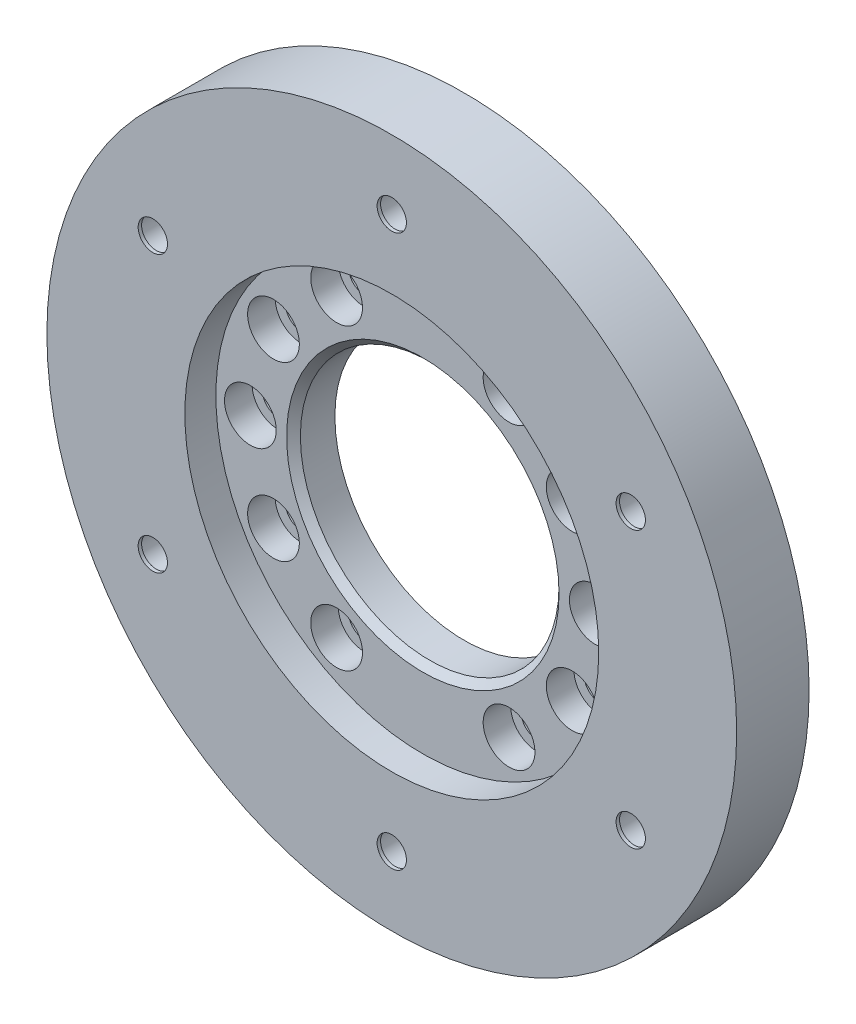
ISO-10303-21;
HEADER;
FILE_DESCRIPTION(('STEP AP214'),'2;1');
FILE_NAME('part.step','',(''),(''),'','','');
FILE_SCHEMA(('AUTOMOTIVE_DESIGN { 1 0 10303 214 1 1 1 1 }'));
ENDSEC;
DATA;
#1=APPLICATION_CONTEXT('core data for automotive mechanical design processes');
#2=APPLICATION_PROTOCOL_DEFINITION('international standard','automotive_design',2000,#1);
#3=PRODUCT_CONTEXT('',#1,'mechanical');
#4=PRODUCT('Part','Part','',(#3));
#5=PRODUCT_RELATED_PRODUCT_CATEGORY('part','',(#4));
#6=PRODUCT_DEFINITION_FORMATION('','',#4);
#7=PRODUCT_DEFINITION_CONTEXT('part definition',#1,'design');
#8=PRODUCT_DEFINITION('design','',#6,#7);
#9=PRODUCT_DEFINITION_SHAPE('','',#8);
#10=(LENGTH_UNIT() NAMED_UNIT(*) SI_UNIT(.MILLI.,.METRE.));
#11=(NAMED_UNIT(*) PLANE_ANGLE_UNIT() SI_UNIT($,.RADIAN.));
#12=(NAMED_UNIT(*) SI_UNIT($,.STERADIAN.) SOLID_ANGLE_UNIT());
#13=UNCERTAINTY_MEASURE_WITH_UNIT(LENGTH_MEASURE(1.E-05),#10,'distance_accuracy_value','');
#14=(GEOMETRIC_REPRESENTATION_CONTEXT(3) GLOBAL_UNCERTAINTY_ASSIGNED_CONTEXT((#13)) GLOBAL_UNIT_ASSIGNED_CONTEXT((#10,
#11,#12)) REPRESENTATION_CONTEXT('',''));
#15=CARTESIAN_POINT('',(0.,0.,0.));
#16=DIRECTION('',(0.,0.,1.));
#17=DIRECTION('',(1.,0.,0.));
#18=AXIS2_PLACEMENT_3D('',#15,#16,#17);
#19=CARTESIAN_POINT('',(0.,0.,21.));
#20=DIRECTION('',(0.,0.,-1.));
#21=DIRECTION('',(-1.,0.,0.));
#22=AXIS2_PLACEMENT_3D('',#19,#20,#21);
#23=CYLINDRICAL_SURFACE('',#22,100.);
#24=CARTESIAN_POINT('',(0.,0.,21.));
#25=DIRECTION('',(0.,0.,1.));
#26=DIRECTION('',(1.,0.,0.));
#27=AXIS2_PLACEMENT_3D('',#24,#25,#26);
#28=CIRCLE('',#27,100.);
#29=CARTESIAN_POINT('',(-100.,0.,21.));
#30=VERTEX_POINT('',#29);
#31=EDGE_CURVE('E41',#30,#30,#28,.T.);
#32=CARTESIAN_POINT('',(0.,0.,0.));
#33=DIRECTION('',(0.,0.,1.));
#34=DIRECTION('',(1.,0.,0.));
#35=AXIS2_PLACEMENT_3D('',#32,#33,#34);
#36=CIRCLE('',#35,100.);
#37=CARTESIAN_POINT('',(-100.,0.,0.));
#38=VERTEX_POINT('',#37);
#39=EDGE_CURVE('E45',#38,#38,#36,.T.);
#40=CARTESIAN_POINT('',(-100.,0.,21.));
#41=CARTESIAN_POINT('',(-100.,0.,20.78125));
#42=CARTESIAN_POINT('',(-100.,0.,20.5625));
#43=CARTESIAN_POINT('',(-100.,0.,20.125));
#44=CARTESIAN_POINT('',(-100.,0.,19.90625));
#45=CARTESIAN_POINT('',(-100.,0.,19.46875));
#46=CARTESIAN_POINT('',(-100.,0.,19.25));
#47=CARTESIAN_POINT('',(-100.,0.,18.8125));
#48=CARTESIAN_POINT('',(-100.,0.,18.59375));
#49=CARTESIAN_POINT('',(-100.,0.,18.15625));
#50=CARTESIAN_POINT('',(-100.,0.,17.9375));
#51=CARTESIAN_POINT('',(-100.,0.,17.5));
#52=CARTESIAN_POINT('',(-100.,0.,17.28125));
#53=CARTESIAN_POINT('',(-100.,0.,16.84375));
#54=CARTESIAN_POINT('',(-100.,0.,16.625));
#55=CARTESIAN_POINT('',(-100.,0.,16.1875));
#56=CARTESIAN_POINT('',(-100.,0.,15.96875));
#57=CARTESIAN_POINT('',(-100.,0.,15.53125));
#58=CARTESIAN_POINT('',(-100.,0.,15.3125));
#59=CARTESIAN_POINT('',(-100.,0.,14.875));
#60=CARTESIAN_POINT('',(-100.,0.,14.65625));
#61=CARTESIAN_POINT('',(-100.,0.,14.21875));
#62=CARTESIAN_POINT('',(-100.,0.,14.));
#63=CARTESIAN_POINT('',(-100.,0.,13.5625));
#64=CARTESIAN_POINT('',(-100.,0.,13.34375));
#65=CARTESIAN_POINT('',(-100.,0.,12.90625));
#66=CARTESIAN_POINT('',(-100.,0.,12.6875));
#67=CARTESIAN_POINT('',(-100.,0.,12.25));
#68=CARTESIAN_POINT('',(-100.,0.,12.03125));
#69=CARTESIAN_POINT('',(-100.,0.,11.59375));
#70=CARTESIAN_POINT('',(-100.,0.,11.375));
#71=CARTESIAN_POINT('',(-100.,0.,10.9375));
#72=CARTESIAN_POINT('',(-100.,0.,10.71875));
#73=CARTESIAN_POINT('',(-100.,0.,10.28125));
#74=CARTESIAN_POINT('',(-100.,0.,10.0625));
#75=CARTESIAN_POINT('',(-100.,0.,9.625));
#76=CARTESIAN_POINT('',(-100.,0.,9.40625));
#77=CARTESIAN_POINT('',(-100.,0.,8.96875));
#78=CARTESIAN_POINT('',(-100.,0.,8.75));
#79=CARTESIAN_POINT('',(-100.,0.,8.3125));
#80=CARTESIAN_POINT('',(-100.,0.,8.09375));
#81=CARTESIAN_POINT('',(-100.,0.,7.65625));
#82=CARTESIAN_POINT('',(-100.,0.,7.4375));
#83=CARTESIAN_POINT('',(-100.,0.,7.));
#84=CARTESIAN_POINT('',(-100.,0.,6.78125));
#85=CARTESIAN_POINT('',(-100.,0.,6.34375));
#86=CARTESIAN_POINT('',(-100.,0.,6.125));
#87=CARTESIAN_POINT('',(-100.,0.,5.6875));
#88=CARTESIAN_POINT('',(-100.,0.,5.46875));
#89=CARTESIAN_POINT('',(-100.,0.,5.03125));
#90=CARTESIAN_POINT('',(-100.,0.,4.8125));
#91=CARTESIAN_POINT('',(-100.,0.,4.375));
#92=CARTESIAN_POINT('',(-100.,0.,4.15625));
#93=CARTESIAN_POINT('',(-100.,0.,3.71875));
#94=CARTESIAN_POINT('',(-100.,0.,3.5));
#95=CARTESIAN_POINT('',(-100.,0.,3.0625));
#96=CARTESIAN_POINT('',(-100.,0.,2.84375));
#97=CARTESIAN_POINT('',(-100.,0.,2.40625));
#98=CARTESIAN_POINT('',(-100.,0.,2.1875));
#99=CARTESIAN_POINT('',(-100.,0.,1.75));
#100=CARTESIAN_POINT('',(-100.,0.,1.53125));
#101=CARTESIAN_POINT('',(-100.,0.,1.09375));
#102=CARTESIAN_POINT('',(-100.,0.,0.875000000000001));
#103=CARTESIAN_POINT('',(-100.,0.,0.4375));
#104=CARTESIAN_POINT('',(-100.,0.,0.21875));
#105=CARTESIAN_POINT('',(-100.,0.,0.));
#106=B_SPLINE_CURVE_WITH_KNOTS('',3,(#40,#41,#42,#43,#44,#45,#46,#47,#48,#49,#50,#51,#52,#53,
#54,#55,#56,#57,#58,#59,#60,#61,#62,#63,#64,#65,#66,#67,#68,#69,#70,#71,#72,#73,#74,#75,#76,#77,
#78,#79,#80,#81,#82,#83,#84,#85,#86,#87,#88,#89,#90,#91,#92,#93,#94,#95,#96,#97,#98,#99,#100,
#101,#102,#103,#104,#105),.UNSPECIFIED.,.F.,.F.,(4,2,2,2,2,2,2,2,2,2,2,2,2,2,2,2,2,2,2,2,2,2,2,
2,2,2,2,2,2,2,2,2,4),(0.,0.656249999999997,1.3125,1.96875,2.625,3.28125,3.9375,4.59375,5.25,
5.90625,6.5625,7.21875,7.875,8.53125,9.1875,9.84375,10.5,11.15625,11.8125,12.46875,13.125,
13.78125,14.4375,15.09375,15.75,16.40625,17.0625,17.71875,18.375,19.03125,19.6875,20.34375,21.),.UNSPECIFIED.);
#107=EDGE_CURVE('BSEAM30',#30,#38,#106,.T.);
#108=ORIENTED_EDGE('',*,*,#31,.F.);
#109=ORIENTED_EDGE('',*,*,#39,.T.);
#110=ORIENTED_EDGE('',*,*,#107,.T.);
#111=ORIENTED_EDGE('',*,*,#107,.F.);
#112=EDGE_LOOP('',(#108,#110,#109,#111));
#113=FACE_BOUND('',#112,.T.);
#114=ADVANCED_FACE('F30',(#113),#23,.T.);
#115=CARTESIAN_POINT('',(0.,0.,21.));
#116=DIRECTION('',(0.,0.,1.));
#117=DIRECTION('',(1.,0.,0.));
#118=AXIS2_PLACEMENT_3D('',#115,#116,#117);
#119=PLANE('',#118);
#120=CARTESIAN_POINT('',(0.,0.,21.));
#121=DIRECTION('',(0.,0.,1.));
#122=DIRECTION('',(1.,0.,0.));
#123=AXIS2_PLACEMENT_3D('',#120,#121,#122);
#124=CIRCLE('',#123,60.);
#125=CARTESIAN_POINT('',(60.,0.,21.));
#126=VERTEX_POINT('',#125);
#127=EDGE_CURVE('E123',#126,#126,#124,.T.);
#128=ORIENTED_EDGE('',*,*,#127,.F.);
#129=EDGE_LOOP('',(#128));
#130=FACE_BOUND('',#129,.T.);
#131=CARTESIAN_POINT('',(-69.2820323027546,40.0000000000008,21.));
#132=DIRECTION('',(0.,0.,1.));
#133=DIRECTION('',(1.,0.,0.));
#134=AXIS2_PLACEMENT_3D('',#131,#132,#133);
#135=CIRCLE('',#134,4.24999999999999);
#136=CARTESIAN_POINT('',(-65.0320323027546,40.0000000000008,21.));
#137=VERTEX_POINT('',#136);
#138=EDGE_CURVE('E48',#137,#137,#135,.T.);
#139=ORIENTED_EDGE('',*,*,#138,.F.);
#140=EDGE_LOOP('',(#139));
#141=FACE_BOUND('',#140,.T.);
#142=CARTESIAN_POINT('',(-69.2820323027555,-39.9999999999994,21.));
#143=DIRECTION('',(0.,0.,1.));
#144=DIRECTION('',(1.,0.,0.));
#145=AXIS2_PLACEMENT_3D('',#142,#143,#144);
#146=CIRCLE('',#145,4.24999999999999);
#147=CARTESIAN_POINT('',(-65.0320323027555,-39.9999999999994,21.));
#148=VERTEX_POINT('',#147);
#149=EDGE_CURVE('E53',#148,#148,#146,.T.);
#150=ORIENTED_EDGE('',*,*,#149,.F.);
#151=EDGE_LOOP('',(#150));
#152=FACE_BOUND('',#151,.T.);
#153=CARTESIAN_POINT('',(-5.58637337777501E-13,-80.,21.));
#154=DIRECTION('',(0.,0.,1.));
#155=DIRECTION('',(1.,0.,0.));
#156=AXIS2_PLACEMENT_3D('',#153,#154,#155);
#157=CIRCLE('',#156,4.24999999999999);
#158=CARTESIAN_POINT('',(4.24999999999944,-80.,21.));
#159=VERTEX_POINT('',#158);
#160=EDGE_CURVE('E58',#159,#159,#157,.T.);
#161=ORIENTED_EDGE('',*,*,#160,.F.);
#162=EDGE_LOOP('',(#161));
#163=FACE_BOUND('',#162,.T.);
#164=CARTESIAN_POINT('',(69.2820323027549,-40.0000000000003,21.));
#165=DIRECTION('',(0.,0.,1.));
#166=DIRECTION('',(1.,0.,0.));
#167=AXIS2_PLACEMENT_3D('',#164,#165,#166);
#168=CIRCLE('',#167,4.24999999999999);
#169=CARTESIAN_POINT('',(73.5320323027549,-40.0000000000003,21.));
#170=VERTEX_POINT('',#169);
#171=EDGE_CURVE('E63',#170,#170,#168,.T.);
#172=ORIENTED_EDGE('',*,*,#171,.F.);
#173=EDGE_LOOP('',(#172));
#174=FACE_BOUND('',#173,.T.);
#175=CARTESIAN_POINT('',(69.2820323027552,39.9999999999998,21.));
#176=DIRECTION('',(0.,0.,1.));
#177=DIRECTION('',(1.,0.,0.));
#178=AXIS2_PLACEMENT_3D('',#175,#176,#177);
#179=CIRCLE('',#178,4.24999999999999);
#180=CARTESIAN_POINT('',(73.5320323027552,39.9999999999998,21.));
#181=VERTEX_POINT('',#180);
#182=EDGE_CURVE('E68',#181,#181,#179,.T.);
#183=ORIENTED_EDGE('',*,*,#182,.F.);
#184=EDGE_LOOP('',(#183));
#185=FACE_BOUND('',#184,.T.);
#186=CARTESIAN_POINT('',(0.,80.,21.));
#187=DIRECTION('',(0.,0.,1.));
#188=DIRECTION('',(1.,0.,0.));
#189=AXIS2_PLACEMENT_3D('',#186,#187,#188);
#190=CIRCLE('',#189,4.24999999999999);
#191=CARTESIAN_POINT('',(4.24999999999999,80.,21.));
#192=VERTEX_POINT('',#191);
#193=EDGE_CURVE('E73',#192,#192,#190,.T.);
#194=ORIENTED_EDGE('',*,*,#193,.F.);
#195=EDGE_LOOP('',(#194));
#196=FACE_BOUND('',#195,.T.);
#197=ORIENTED_EDGE('',*,*,#31,.T.);
#198=EDGE_LOOP('',(#197));
#199=FACE_BOUND('',#198,.T.);
#200=ADVANCED_FACE('F258',(#130,#141,#152,#163,#174,#185,#196,#199),#119,.T.);
#201=CARTESIAN_POINT('',(0.,0.,0.));
#202=DIRECTION('',(0.,0.,1.));
#203=DIRECTION('',(1.,0.,0.));
#204=AXIS2_PLACEMENT_3D('',#201,#202,#203);
#205=PLANE('',#204);
#206=CARTESIAN_POINT('',(0.,0.,0.));
#207=DIRECTION('',(0.,0.,1.));
#208=DIRECTION('',(1.,0.,0.));
#209=AXIS2_PLACEMENT_3D('',#206,#207,#208);
#210=CIRCLE('',#209,37.5);
#211=CARTESIAN_POINT('',(37.5,0.,0.));
#212=VERTEX_POINT('',#211);
#213=EDGE_CURVE('E248',#212,#212,#210,.F.);
#214=ORIENTED_EDGE('',*,*,#213,.F.);
#215=EDGE_LOOP('',(#214));
#216=FACE_BOUND('',#215,.T.);
#217=CARTESIAN_POINT('',(24.9999999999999,43.301270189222,-1.196959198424E-13));
#218=DIRECTION('',(0.,0.,1.));
#219=DIRECTION('',(1.,0.,0.));
#220=AXIS2_PLACEMENT_3D('',#217,#218,#219);
#221=CIRCLE('',#220,4.50000000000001);
#222=CARTESIAN_POINT('',(29.4999999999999,43.301270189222,-1.196959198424E-13));
#223=VERTEX_POINT('',#222);
#224=EDGE_CURVE('E236',#223,#223,#221,.T.);
#225=ORIENTED_EDGE('',*,*,#224,.T.);
#226=EDGE_LOOP('',(#225));
#227=FACE_BOUND('',#226,.T.);
#228=CARTESIAN_POINT('',(43.3012701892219,25.,-1.196959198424E-13));
#229=DIRECTION('',(0.,0.,1.));
#230=DIRECTION('',(1.,0.,0.));
#231=AXIS2_PLACEMENT_3D('',#228,#229,#230);
#232=CIRCLE('',#231,4.5);
#233=CARTESIAN_POINT('',(47.8012701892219,25.,-1.196959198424E-13));
#234=VERTEX_POINT('',#233);
#235=EDGE_CURVE('E224',#234,#234,#232,.T.);
#236=ORIENTED_EDGE('',*,*,#235,.T.);
#237=EDGE_LOOP('',(#236));
#238=FACE_BOUND('',#237,.T.);
#239=CARTESIAN_POINT('',(24.9999999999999,-43.301270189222,-1.196959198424E-13));
#240=DIRECTION('',(0.,0.,1.));
#241=DIRECTION('',(1.,0.,0.));
#242=AXIS2_PLACEMENT_3D('',#239,#240,#241);
#243=CIRCLE('',#242,4.50000000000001);
#244=CARTESIAN_POINT('',(29.4999999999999,-43.301270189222,-1.196959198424E-13));
#245=VERTEX_POINT('',#244);
#246=EDGE_CURVE('E212',#245,#245,#243,.T.);
#247=ORIENTED_EDGE('',*,*,#246,.T.);
#248=EDGE_LOOP('',(#247));
#249=FACE_BOUND('',#248,.T.);
#250=CARTESIAN_POINT('',(43.3012701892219,-25.,-1.196959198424E-13));
#251=DIRECTION('',(0.,0.,1.));
#252=DIRECTION('',(1.,0.,0.));
#253=AXIS2_PLACEMENT_3D('',#250,#251,#252);
#254=CIRCLE('',#253,4.5);
#255=CARTESIAN_POINT('',(47.8012701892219,-25.,-1.196959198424E-13));
#256=VERTEX_POINT('',#255);
#257=EDGE_CURVE('E200',#256,#256,#254,.T.);
#258=ORIENTED_EDGE('',*,*,#257,.T.);
#259=EDGE_LOOP('',(#258));
#260=FACE_BOUND('',#259,.T.);
#261=CARTESIAN_POINT('',(50.,0.,-1.196959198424E-13));
#262=DIRECTION('',(0.,0.,1.));
#263=DIRECTION('',(1.,0.,0.));
#264=AXIS2_PLACEMENT_3D('',#261,#262,#263);
#265=CIRCLE('',#264,4.5);
#266=CARTESIAN_POINT('',(54.5,0.,-1.196959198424E-13));
#267=VERTEX_POINT('',#266);
#268=EDGE_CURVE('E188',#267,#267,#265,.T.);
#269=ORIENTED_EDGE('',*,*,#268,.T.);
#270=EDGE_LOOP('',(#269));
#271=FACE_BOUND('',#270,.T.);
#272=CARTESIAN_POINT('',(-24.9999999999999,-43.301270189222,-1.23165366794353E-13));
#273=DIRECTION('',(0.,0.,1.));
#274=DIRECTION('',(1.,0.,0.));
#275=AXIS2_PLACEMENT_3D('',#272,#273,#274);
#276=CIRCLE('',#275,4.5);
#277=CARTESIAN_POINT('',(-20.4999999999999,-43.301270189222,-1.23165366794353E-13));
#278=VERTEX_POINT('',#277);
#279=EDGE_CURVE('E176',#278,#278,#276,.T.);
#280=ORIENTED_EDGE('',*,*,#279,.T.);
#281=EDGE_LOOP('',(#280));
#282=FACE_BOUND('',#281,.T.);
#283=CARTESIAN_POINT('',(-43.3012701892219,-25.,-1.23165366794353E-13));
#284=DIRECTION('',(0.,0.,1.));
#285=DIRECTION('',(1.,0.,0.));
#286=AXIS2_PLACEMENT_3D('',#283,#284,#285);
#287=CIRCLE('',#286,4.5);
#288=CARTESIAN_POINT('',(-38.8012701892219,-25.,-1.23165366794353E-13));
#289=VERTEX_POINT('',#288);
#290=EDGE_CURVE('E164',#289,#289,#287,.T.);
#291=ORIENTED_EDGE('',*,*,#290,.T.);
#292=EDGE_LOOP('',(#291));
#293=FACE_BOUND('',#292,.T.);
#294=CARTESIAN_POINT('',(-24.9999999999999,43.301270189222,-1.23165366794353E-13));
#295=DIRECTION('',(0.,0.,1.));
#296=DIRECTION('',(1.,0.,0.));
#297=AXIS2_PLACEMENT_3D('',#294,#295,#296);
#298=CIRCLE('',#297,4.5);
#299=CARTESIAN_POINT('',(-20.4999999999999,43.301270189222,-1.23165366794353E-13));
#300=VERTEX_POINT('',#299);
#301=EDGE_CURVE('E152',#300,#300,#298,.T.);
#302=ORIENTED_EDGE('',*,*,#301,.T.);
#303=EDGE_LOOP('',(#302));
#304=FACE_BOUND('',#303,.T.);
#305=CARTESIAN_POINT('',(-43.3012701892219,25.,-1.23165366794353E-13));
#306=DIRECTION('',(0.,0.,1.));
#307=DIRECTION('',(1.,0.,0.));
#308=AXIS2_PLACEMENT_3D('',#305,#306,#307);
#309=CIRCLE('',#308,4.5);
#310=CARTESIAN_POINT('',(-38.8012701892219,25.,-1.23165366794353E-13));
#311=VERTEX_POINT('',#310);
#312=EDGE_CURVE('E140',#311,#311,#309,.T.);
#313=ORIENTED_EDGE('',*,*,#312,.T.);
#314=EDGE_LOOP('',(#313));
#315=FACE_BOUND('',#314,.T.);
#316=CARTESIAN_POINT('',(-50.,0.,-1.23165366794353E-13));
#317=DIRECTION('',(0.,0.,1.));
#318=DIRECTION('',(1.,0.,0.));
#319=AXIS2_PLACEMENT_3D('',#316,#317,#318);
#320=CIRCLE('',#319,4.5);
#321=CARTESIAN_POINT('',(-45.5,0.,-1.23165366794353E-13));
#322=VERTEX_POINT('',#321);
#323=EDGE_CURVE('E126',#322,#322,#320,.T.);
#324=ORIENTED_EDGE('',*,*,#323,.T.);
#325=EDGE_LOOP('',(#324));
#326=FACE_BOUND('',#325,.T.);
#327=CARTESIAN_POINT('',(-69.2820323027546,40.0000000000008,-1.2490009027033E-13));
#328=DIRECTION('',(0.,0.,-1.));
#329=DIRECTION('',(-1.,0.,0.));
#330=AXIS2_PLACEMENT_3D('',#327,#328,#329);
#331=CIRCLE('',#330,4.99999999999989);
#332=CARTESIAN_POINT('',(-74.2820323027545,40.0000000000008,-1.2490009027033E-13));
#333=VERTEX_POINT('',#332);
#334=EDGE_CURVE('E119',#333,#333,#331,.T.);
#335=ORIENTED_EDGE('',*,*,#334,.F.);
#336=EDGE_LOOP('',(#335));
#337=FACE_BOUND('',#336,.T.);
#338=CARTESIAN_POINT('',(-69.2820323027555,-39.9999999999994,-1.2490009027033E-13));
#339=DIRECTION('',(0.,0.,-1.));
#340=DIRECTION('',(-1.,0.,0.));
#341=AXIS2_PLACEMENT_3D('',#338,#339,#340);
#342=CIRCLE('',#341,4.99999999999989);
#343=CARTESIAN_POINT('',(-74.2820323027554,-39.9999999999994,-1.2490009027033E-13));
#344=VERTEX_POINT('',#343);
#345=EDGE_CURVE('E51',#344,#344,#342,.T.);
#346=ORIENTED_EDGE('',*,*,#345,.F.);
#347=EDGE_LOOP('',(#346));
#348=FACE_BOUND('',#347,.T.);
#349=CARTESIAN_POINT('',(-5.58637337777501E-13,-80.,-1.2490009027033E-13));
#350=DIRECTION('',(0.,0.,-1.));
#351=DIRECTION('',(-1.,0.,0.));
#352=AXIS2_PLACEMENT_3D('',#349,#350,#351);
#353=CIRCLE('',#352,4.99999999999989);
#354=CARTESIAN_POINT('',(-5.00000000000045,-80.,-1.2490009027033E-13));
#355=VERTEX_POINT('',#354);
#356=EDGE_CURVE('E56',#355,#355,#353,.T.);
#357=ORIENTED_EDGE('',*,*,#356,.F.);
#358=EDGE_LOOP('',(#357));
#359=FACE_BOUND('',#358,.T.);
#360=CARTESIAN_POINT('',(69.2820323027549,-40.0000000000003,-1.2490009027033E-13));
#361=DIRECTION('',(0.,0.,-1.));
#362=DIRECTION('',(-1.,0.,0.));
#363=AXIS2_PLACEMENT_3D('',#360,#361,#362);
#364=CIRCLE('',#363,4.99999999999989);
#365=CARTESIAN_POINT('',(64.282032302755,-40.0000000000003,-1.2490009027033E-13));
#366=VERTEX_POINT('',#365);
#367=EDGE_CURVE('E61',#366,#366,#364,.T.);
#368=ORIENTED_EDGE('',*,*,#367,.F.);
#369=EDGE_LOOP('',(#368));
#370=FACE_BOUND('',#369,.T.);
#371=CARTESIAN_POINT('',(69.2820323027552,39.9999999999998,-1.2490009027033E-13));
#372=DIRECTION('',(0.,0.,-1.));
#373=DIRECTION('',(-1.,0.,0.));
#374=AXIS2_PLACEMENT_3D('',#371,#372,#373);
#375=CIRCLE('',#374,4.99999999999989);
#376=CARTESIAN_POINT('',(64.2820323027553,39.9999999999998,-1.2490009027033E-13));
#377=VERTEX_POINT('',#376);
#378=EDGE_CURVE('E66',#377,#377,#375,.T.);
#379=ORIENTED_EDGE('',*,*,#378,.F.);
#380=EDGE_LOOP('',(#379));
#381=FACE_BOUND('',#380,.T.);
#382=CARTESIAN_POINT('',(0.,80.,-1.2490009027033E-13));
#383=DIRECTION('',(0.,0.,-1.));
#384=DIRECTION('',(-1.,0.,0.));
#385=AXIS2_PLACEMENT_3D('',#382,#383,#384);
#386=CIRCLE('',#385,4.99999999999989);
#387=CARTESIAN_POINT('',(-4.99999999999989,80.,-1.2490009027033E-13));
#388=VERTEX_POINT('',#387);
#389=EDGE_CURVE('E71',#388,#388,#386,.T.);
#390=ORIENTED_EDGE('',*,*,#389,.F.);
#391=EDGE_LOOP('',(#390));
#392=FACE_BOUND('',#391,.T.);
#393=ORIENTED_EDGE('',*,*,#39,.F.);
#394=EDGE_LOOP('',(#393));
#395=FACE_BOUND('',#394,.T.);
#396=ADVANCED_FACE('F254',(#216,#227,#238,#249,#260,#271,#282,#293,#304,#315,#326,#337,#348,
#359,#370,#381,#392,#395),#205,.F.);
#397=CARTESIAN_POINT('',(0.,80.,0.));
#398=DIRECTION('',(0.,0.,-1.));
#399=DIRECTION('',(-1.,0.,0.));
#400=AXIS2_PLACEMENT_3D('',#397,#398,#399);
#401=CYLINDRICAL_SURFACE('',#400,4.24999999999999);
#402=ORIENTED_EDGE('',*,*,#193,.T.);
#403=EDGE_LOOP('',(#402));
#404=FACE_BOUND('',#403,.T.);
#405=CARTESIAN_POINT('',(0.,80.,20.));
#406=DIRECTION('',(0.,0.,-1.));
#407=DIRECTION('',(-1.,0.,0.));
#408=AXIS2_PLACEMENT_3D('',#405,#406,#407);
#409=CIRCLE('',#408,4.24999999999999);
#410=CARTESIAN_POINT('',(-4.24999999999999,80.,20.));
#411=VERTEX_POINT('',#410);
#412=EDGE_CURVE('E76',#411,#411,#409,.T.);
#413=ORIENTED_EDGE('',*,*,#412,.T.);
#414=EDGE_LOOP('',(#413));
#415=FACE_BOUND('',#414,.T.);
#416=ADVANCED_FACE('F257',(#404,#415),#401,.F.);
#417=CARTESIAN_POINT('',(4.24999999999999,80.,19.9999999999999));
#418=DIRECTION('',(0.,0.,1.));
#419=DIRECTION('',(1.,0.,0.));
#420=AXIS2_PLACEMENT_3D('',#417,#418,#419);
#421=PLANE('',#420);
#422=ORIENTED_EDGE('',*,*,#412,.F.);
#423=EDGE_LOOP('',(#422));
#424=FACE_BOUND('',#423,.T.);
#425=CARTESIAN_POINT('',(0.,80.,19.9999999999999));
#426=DIRECTION('',(0.,0.,-1.));
#427=DIRECTION('',(-1.,0.,0.));
#428=AXIS2_PLACEMENT_3D('',#425,#426,#427);
#429=CIRCLE('',#428,4.99999999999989);
#430=CARTESIAN_POINT('',(-4.99999999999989,80.,19.9999999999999));
#431=VERTEX_POINT('',#430);
#432=EDGE_CURVE('E81',#431,#431,#429,.T.);
#433=ORIENTED_EDGE('',*,*,#432,.T.);
#434=EDGE_LOOP('',(#433));
#435=FACE_BOUND('',#434,.T.);
#436=ADVANCED_FACE('F305',(#424,#435),#421,.F.);
#437=CARTESIAN_POINT('',(0.,80.,0.));
#438=DIRECTION('',(0.,0.,-1.));
#439=DIRECTION('',(-1.,0.,0.));
#440=AXIS2_PLACEMENT_3D('',#437,#438,#439);
#441=CYLINDRICAL_SURFACE('',#440,4.99999999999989);
#442=ORIENTED_EDGE('',*,*,#432,.F.);
#443=EDGE_LOOP('',(#442));
#444=FACE_BOUND('',#443,.T.);
#445=ORIENTED_EDGE('',*,*,#389,.T.);
#446=EDGE_LOOP('',(#445));
#447=FACE_BOUND('',#446,.T.);
#448=ADVANCED_FACE('F309',(#444,#447),#441,.F.);
#449=CARTESIAN_POINT('',(69.2820323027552,39.9999999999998,0.));
#450=DIRECTION('',(0.,0.,-1.));
#451=DIRECTION('',(-1.,0.,0.));
#452=AXIS2_PLACEMENT_3D('',#449,#450,#451);
#453=CYLINDRICAL_SURFACE('',#452,4.24999999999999);
#454=ORIENTED_EDGE('',*,*,#182,.T.);
#455=EDGE_LOOP('',(#454));
#456=FACE_BOUND('',#455,.T.);
#457=CARTESIAN_POINT('',(69.2820323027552,39.9999999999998,20.));
#458=DIRECTION('',(0.,0.,-1.));
#459=DIRECTION('',(-1.,0.,0.));
#460=AXIS2_PLACEMENT_3D('',#457,#458,#459);
#461=CIRCLE('',#460,4.24999999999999);
#462=CARTESIAN_POINT('',(65.0320323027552,39.9999999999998,20.));
#463=VERTEX_POINT('',#462);
#464=EDGE_CURVE('E72',#463,#463,#461,.T.);
#465=ORIENTED_EDGE('',*,*,#464,.T.);
#466=EDGE_LOOP('',(#465));
#467=FACE_BOUND('',#466,.T.);
#468=ADVANCED_FACE('F313',(#456,#467),#453,.F.);
#469=CARTESIAN_POINT('',(73.5320323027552,39.9999999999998,19.9999999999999));
#470=DIRECTION('',(0.,0.,1.));
#471=DIRECTION('',(1.,0.,0.));
#472=AXIS2_PLACEMENT_3D('',#469,#470,#471);
#473=PLANE('',#472);
#474=ORIENTED_EDGE('',*,*,#464,.F.);
#475=EDGE_LOOP('',(#474));
#476=FACE_BOUND('',#475,.T.);
#477=CARTESIAN_POINT('',(69.2820323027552,39.9999999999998,19.9999999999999));
#478=DIRECTION('',(0.,0.,-1.));
#479=DIRECTION('',(-1.,0.,0.));
#480=AXIS2_PLACEMENT_3D('',#477,#478,#479);
#481=CIRCLE('',#480,4.99999999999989);
#482=CARTESIAN_POINT('',(64.2820323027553,39.9999999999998,19.9999999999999));
#483=VERTEX_POINT('',#482);
#484=EDGE_CURVE('E88',#483,#483,#481,.T.);
#485=ORIENTED_EDGE('',*,*,#484,.T.);
#486=EDGE_LOOP('',(#485));
#487=FACE_BOUND('',#486,.T.);
#488=ADVANCED_FACE('F317',(#476,#487),#473,.F.);
#489=CARTESIAN_POINT('',(69.2820323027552,39.9999999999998,0.));
#490=DIRECTION('',(0.,0.,-1.));
#491=DIRECTION('',(-1.,0.,0.));
#492=AXIS2_PLACEMENT_3D('',#489,#490,#491);
#493=CYLINDRICAL_SURFACE('',#492,4.99999999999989);
#494=ORIENTED_EDGE('',*,*,#484,.F.);
#495=EDGE_LOOP('',(#494));
#496=FACE_BOUND('',#495,.T.);
#497=ORIENTED_EDGE('',*,*,#378,.T.);
#498=EDGE_LOOP('',(#497));
#499=FACE_BOUND('',#498,.T.);
#500=ADVANCED_FACE('F321',(#496,#499),#493,.F.);
#501=CARTESIAN_POINT('',(69.2820323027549,-40.0000000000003,0.));
#502=DIRECTION('',(0.,0.,-1.));
#503=DIRECTION('',(-1.,0.,0.));
#504=AXIS2_PLACEMENT_3D('',#501,#502,#503);
#505=CYLINDRICAL_SURFACE('',#504,4.24999999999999);
#506=ORIENTED_EDGE('',*,*,#171,.T.);
#507=EDGE_LOOP('',(#506));
#508=FACE_BOUND('',#507,.T.);
#509=CARTESIAN_POINT('',(69.2820323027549,-40.0000000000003,20.));
#510=DIRECTION('',(0.,0.,-1.));
#511=DIRECTION('',(-1.,0.,0.));
#512=AXIS2_PLACEMENT_3D('',#509,#510,#511);
#513=CIRCLE('',#512,4.24999999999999);
#514=CARTESIAN_POINT('',(65.0320323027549,-40.0000000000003,20.));
#515=VERTEX_POINT('',#514);
#516=EDGE_CURVE('E67',#515,#515,#513,.T.);
#517=ORIENTED_EDGE('',*,*,#516,.T.);
#518=EDGE_LOOP('',(#517));
#519=FACE_BOUND('',#518,.T.);
#520=ADVANCED_FACE('F325',(#508,#519),#505,.F.);
#521=CARTESIAN_POINT('',(73.5320323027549,-40.0000000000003,19.9999999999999));
#522=DIRECTION('',(0.,0.,1.));
#523=DIRECTION('',(1.,0.,0.));
#524=AXIS2_PLACEMENT_3D('',#521,#522,#523);
#525=PLANE('',#524);
#526=ORIENTED_EDGE('',*,*,#516,.F.);
#527=EDGE_LOOP('',(#526));
#528=FACE_BOUND('',#527,.T.);
#529=CARTESIAN_POINT('',(69.2820323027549,-40.0000000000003,19.9999999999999));
#530=DIRECTION('',(0.,0.,-1.));
#531=DIRECTION('',(-1.,0.,0.));
#532=AXIS2_PLACEMENT_3D('',#529,#530,#531);
#533=CIRCLE('',#532,4.99999999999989);
#534=CARTESIAN_POINT('',(64.282032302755,-40.0000000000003,19.9999999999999));
#535=VERTEX_POINT('',#534);
#536=EDGE_CURVE('E95',#535,#535,#533,.T.);
#537=ORIENTED_EDGE('',*,*,#536,.T.);
#538=EDGE_LOOP('',(#537));
#539=FACE_BOUND('',#538,.T.);
#540=ADVANCED_FACE('F329',(#528,#539),#525,.F.);
#541=CARTESIAN_POINT('',(69.2820323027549,-40.0000000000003,0.));
#542=DIRECTION('',(0.,0.,-1.));
#543=DIRECTION('',(-1.,0.,0.));
#544=AXIS2_PLACEMENT_3D('',#541,#542,#543);
#545=CYLINDRICAL_SURFACE('',#544,4.99999999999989);
#546=ORIENTED_EDGE('',*,*,#536,.F.);
#547=EDGE_LOOP('',(#546));
#548=FACE_BOUND('',#547,.T.);
#549=ORIENTED_EDGE('',*,*,#367,.T.);
#550=EDGE_LOOP('',(#549));
#551=FACE_BOUND('',#550,.T.);
#552=ADVANCED_FACE('F333',(#548,#551),#545,.F.);
#553=CARTESIAN_POINT('',(-5.58637337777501E-13,-80.,0.));
#554=DIRECTION('',(0.,0.,-1.));
#555=DIRECTION('',(-1.,0.,0.));
#556=AXIS2_PLACEMENT_3D('',#553,#554,#555);
#557=CYLINDRICAL_SURFACE('',#556,4.24999999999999);
#558=ORIENTED_EDGE('',*,*,#160,.T.);
#559=EDGE_LOOP('',(#558));
#560=FACE_BOUND('',#559,.T.);
#561=CARTESIAN_POINT('',(-5.58637337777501E-13,-80.,20.));
#562=DIRECTION('',(0.,0.,-1.));
#563=DIRECTION('',(-1.,0.,0.));
#564=AXIS2_PLACEMENT_3D('',#561,#562,#563);
#565=CIRCLE('',#564,4.24999999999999);
#566=CARTESIAN_POINT('',(-4.25000000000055,-80.,20.));
#567=VERTEX_POINT('',#566);
#568=EDGE_CURVE('E62',#567,#567,#565,.T.);
#569=ORIENTED_EDGE('',*,*,#568,.T.);
#570=EDGE_LOOP('',(#569));
#571=FACE_BOUND('',#570,.T.);
#572=ADVANCED_FACE('F337',(#560,#571),#557,.F.);
#573=CARTESIAN_POINT('',(4.24999999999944,-80.,19.9999999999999));
#574=DIRECTION('',(0.,0.,1.));
#575=DIRECTION('',(1.,0.,0.));
#576=AXIS2_PLACEMENT_3D('',#573,#574,#575);
#577=PLANE('',#576);
#578=ORIENTED_EDGE('',*,*,#568,.F.);
#579=EDGE_LOOP('',(#578));
#580=FACE_BOUND('',#579,.T.);
#581=CARTESIAN_POINT('',(-5.58637337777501E-13,-80.,19.9999999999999));
#582=DIRECTION('',(0.,0.,-1.));
#583=DIRECTION('',(-1.,0.,0.));
#584=AXIS2_PLACEMENT_3D('',#581,#582,#583);
#585=CIRCLE('',#584,4.99999999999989);
#586=CARTESIAN_POINT('',(-5.00000000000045,-80.,19.9999999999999));
#587=VERTEX_POINT('',#586);
#588=EDGE_CURVE('E102',#587,#587,#585,.T.);
#589=ORIENTED_EDGE('',*,*,#588,.T.);
#590=EDGE_LOOP('',(#589));
#591=FACE_BOUND('',#590,.T.);
#592=ADVANCED_FACE('F341',(#580,#591),#577,.F.);
#593=CARTESIAN_POINT('',(-5.58637337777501E-13,-80.,0.));
#594=DIRECTION('',(0.,0.,-1.));
#595=DIRECTION('',(-1.,0.,0.));
#596=AXIS2_PLACEMENT_3D('',#593,#594,#595);
#597=CYLINDRICAL_SURFACE('',#596,4.99999999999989);
#598=ORIENTED_EDGE('',*,*,#588,.F.);
#599=EDGE_LOOP('',(#598));
#600=FACE_BOUND('',#599,.T.);
#601=ORIENTED_EDGE('',*,*,#356,.T.);
#602=EDGE_LOOP('',(#601));
#603=FACE_BOUND('',#602,.T.);
#604=ADVANCED_FACE('F345',(#600,#603),#597,.F.);
#605=CARTESIAN_POINT('',(-69.2820323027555,-39.9999999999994,0.));
#606=DIRECTION('',(0.,0.,-1.));
#607=DIRECTION('',(-1.,0.,0.));
#608=AXIS2_PLACEMENT_3D('',#605,#606,#607);
#609=CYLINDRICAL_SURFACE('',#608,4.24999999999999);
#610=ORIENTED_EDGE('',*,*,#149,.T.);
#611=EDGE_LOOP('',(#610));
#612=FACE_BOUND('',#611,.T.);
#613=CARTESIAN_POINT('',(-69.2820323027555,-39.9999999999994,20.));
#614=DIRECTION('',(0.,0.,-1.));
#615=DIRECTION('',(-1.,0.,0.));
#616=AXIS2_PLACEMENT_3D('',#613,#614,#615);
#617=CIRCLE('',#616,4.24999999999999);
#618=CARTESIAN_POINT('',(-73.5320323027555,-39.9999999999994,20.));
#619=VERTEX_POINT('',#618);
#620=EDGE_CURVE('E57',#619,#619,#617,.T.);
#621=ORIENTED_EDGE('',*,*,#620,.T.);
#622=EDGE_LOOP('',(#621));
#623=FACE_BOUND('',#622,.T.);
#624=ADVANCED_FACE('F349',(#612,#623),#609,.F.);
#625=CARTESIAN_POINT('',(-65.0320323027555,-39.9999999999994,19.9999999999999));
#626=DIRECTION('',(0.,0.,1.));
#627=DIRECTION('',(1.,0.,0.));
#628=AXIS2_PLACEMENT_3D('',#625,#626,#627);
#629=PLANE('',#628);
#630=ORIENTED_EDGE('',*,*,#620,.F.);
#631=EDGE_LOOP('',(#630));
#632=FACE_BOUND('',#631,.T.);
#633=CARTESIAN_POINT('',(-69.2820323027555,-39.9999999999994,19.9999999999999));
#634=DIRECTION('',(0.,0.,-1.));
#635=DIRECTION('',(-1.,0.,0.));
#636=AXIS2_PLACEMENT_3D('',#633,#634,#635);
#637=CIRCLE('',#636,4.99999999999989);
#638=CARTESIAN_POINT('',(-74.2820323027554,-39.9999999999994,19.9999999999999));
#639=VERTEX_POINT('',#638);
#640=EDGE_CURVE('E109',#639,#639,#637,.T.);
#641=ORIENTED_EDGE('',*,*,#640,.T.);
#642=EDGE_LOOP('',(#641));
#643=FACE_BOUND('',#642,.T.);
#644=ADVANCED_FACE('F353',(#632,#643),#629,.F.);
#645=CARTESIAN_POINT('',(-69.2820323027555,-39.9999999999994,0.));
#646=DIRECTION('',(0.,0.,-1.));
#647=DIRECTION('',(-1.,0.,0.));
#648=AXIS2_PLACEMENT_3D('',#645,#646,#647);
#649=CYLINDRICAL_SURFACE('',#648,4.99999999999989);
#650=ORIENTED_EDGE('',*,*,#640,.F.);
#651=EDGE_LOOP('',(#650));
#652=FACE_BOUND('',#651,.T.);
#653=ORIENTED_EDGE('',*,*,#345,.T.);
#654=EDGE_LOOP('',(#653));
#655=FACE_BOUND('',#654,.T.);
#656=ADVANCED_FACE('F357',(#652,#655),#649,.F.);
#657=CARTESIAN_POINT('',(-69.2820323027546,40.0000000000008,0.));
#658=DIRECTION('',(0.,0.,-1.));
#659=DIRECTION('',(-1.,0.,0.));
#660=AXIS2_PLACEMENT_3D('',#657,#658,#659);
#661=CYLINDRICAL_SURFACE('',#660,4.24999999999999);
#662=ORIENTED_EDGE('',*,*,#138,.T.);
#663=EDGE_LOOP('',(#662));
#664=FACE_BOUND('',#663,.T.);
#665=CARTESIAN_POINT('',(-69.2820323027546,40.0000000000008,20.));
#666=DIRECTION('',(0.,0.,-1.));
#667=DIRECTION('',(-1.,0.,0.));
#668=AXIS2_PLACEMENT_3D('',#665,#666,#667);
#669=CIRCLE('',#668,4.24999999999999);
#670=CARTESIAN_POINT('',(-73.5320323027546,40.0000000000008,20.));
#671=VERTEX_POINT('',#670);
#672=EDGE_CURVE('E52',#671,#671,#669,.T.);
#673=ORIENTED_EDGE('',*,*,#672,.T.);
#674=EDGE_LOOP('',(#673));
#675=FACE_BOUND('',#674,.T.);
#676=ADVANCED_FACE('F361',(#664,#675),#661,.F.);
#677=CARTESIAN_POINT('',(-65.0320323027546,40.0000000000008,19.9999999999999));
#678=DIRECTION('',(0.,0.,1.));
#679=DIRECTION('',(1.,0.,0.));
#680=AXIS2_PLACEMENT_3D('',#677,#678,#679);
#681=PLANE('',#680);
#682=ORIENTED_EDGE('',*,*,#672,.F.);
#683=EDGE_LOOP('',(#682));
#684=FACE_BOUND('',#683,.T.);
#685=CARTESIAN_POINT('',(-69.2820323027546,40.0000000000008,19.9999999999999));
#686=DIRECTION('',(0.,0.,-1.));
#687=DIRECTION('',(-1.,0.,0.));
#688=AXIS2_PLACEMENT_3D('',#685,#686,#687);
#689=CIRCLE('',#688,4.99999999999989);
#690=CARTESIAN_POINT('',(-74.2820323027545,40.0000000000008,19.9999999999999));
#691=VERTEX_POINT('',#690);
#692=EDGE_CURVE('E116',#691,#691,#689,.T.);
#693=ORIENTED_EDGE('',*,*,#692,.T.);
#694=EDGE_LOOP('',(#693));
#695=FACE_BOUND('',#694,.T.);
#696=ADVANCED_FACE('F365',(#684,#695),#681,.F.);
#697=CARTESIAN_POINT('',(-69.2820323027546,40.0000000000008,0.));
#698=DIRECTION('',(0.,0.,-1.));
#699=DIRECTION('',(-1.,0.,0.));
#700=AXIS2_PLACEMENT_3D('',#697,#698,#699);
#701=CYLINDRICAL_SURFACE('',#700,4.99999999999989);
#702=ORIENTED_EDGE('',*,*,#692,.F.);
#703=EDGE_LOOP('',(#702));
#704=FACE_BOUND('',#703,.T.);
#705=ORIENTED_EDGE('',*,*,#334,.T.);
#706=EDGE_LOOP('',(#705));
#707=FACE_BOUND('',#706,.T.);
#708=ADVANCED_FACE('F369',(#704,#707),#701,.F.);
#709=CARTESIAN_POINT('',(0.,0.,12.));
#710=DIRECTION('',(0.,0.,1.));
#711=DIRECTION('',(1.,0.,0.));
#712=AXIS2_PLACEMENT_3D('',#709,#710,#711);
#713=CYLINDRICAL_SURFACE('',#712,60.);
#714=CARTESIAN_POINT('',(0.,0.,12.));
#715=DIRECTION('',(0.,0.,1.));
#716=DIRECTION('',(1.,0.,0.));
#717=AXIS2_PLACEMENT_3D('',#714,#715,#716);
#718=CIRCLE('',#717,60.);
#719=CARTESIAN_POINT('',(60.,0.,12.));
#720=VERTEX_POINT('',#719);
#721=EDGE_CURVE('E122',#720,#720,#718,.T.);
#722=ORIENTED_EDGE('',*,*,#721,.F.);
#723=EDGE_LOOP('',(#722));
#724=FACE_BOUND('',#723,.T.);
#725=ORIENTED_EDGE('',*,*,#127,.T.);
#726=EDGE_LOOP('',(#725));
#727=FACE_BOUND('',#726,.T.);
#728=ADVANCED_FACE('F373',(#724,#727),#713,.F.);
#729=CARTESIAN_POINT('',(0.,0.,12.));
#730=DIRECTION('',(0.,0.,1.));
#731=DIRECTION('',(1.,0.,0.));
#732=AXIS2_PLACEMENT_3D('',#729,#730,#731);
#733=PLANE('',#732);
#734=CARTESIAN_POINT('',(0.,0.,12.));
#735=DIRECTION('',(0.,0.,1.));
#736=DIRECTION('',(1.,0.,0.));
#737=AXIS2_PLACEMENT_3D('',#734,#735,#736);
#738=CIRCLE('',#737,39.5);
#739=CARTESIAN_POINT('',(39.5,0.,12.));
#740=VERTEX_POINT('',#739);
#741=EDGE_CURVE('E10',#740,#740,#738,.F.);
#742=ORIENTED_EDGE('',*,*,#741,.T.);
#743=EDGE_LOOP('',(#742));
#744=FACE_BOUND('',#743,.T.);
#745=CARTESIAN_POINT('',(24.9999999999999,43.301270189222,12.));
#746=DIRECTION('',(0.,0.,1.));
#747=DIRECTION('',(1.,0.,0.));
#748=AXIS2_PLACEMENT_3D('',#745,#746,#747);
#749=CIRCLE('',#748,7.5);
#750=CARTESIAN_POINT('',(32.4999999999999,43.301270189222,12.));
#751=VERTEX_POINT('',#750);
#752=EDGE_CURVE('E245',#751,#751,#749,.T.);
#753=ORIENTED_EDGE('',*,*,#752,.F.);
#754=EDGE_LOOP('',(#753));
#755=FACE_BOUND('',#754,.T.);
#756=CARTESIAN_POINT('',(43.3012701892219,25.,12.));
#757=DIRECTION('',(0.,0.,1.));
#758=DIRECTION('',(1.,0.,0.));
#759=AXIS2_PLACEMENT_3D('',#756,#757,#758);
#760=CIRCLE('',#759,7.49999999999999);
#761=CARTESIAN_POINT('',(50.8012701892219,25.,12.));
#762=VERTEX_POINT('',#761);
#763=EDGE_CURVE('E233',#762,#762,#760,.T.);
#764=ORIENTED_EDGE('',*,*,#763,.F.);
#765=EDGE_LOOP('',(#764));
#766=FACE_BOUND('',#765,.T.);
#767=CARTESIAN_POINT('',(24.9999999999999,-43.301270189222,12.));
#768=DIRECTION('',(0.,0.,1.));
#769=DIRECTION('',(1.,0.,0.));
#770=AXIS2_PLACEMENT_3D('',#767,#768,#769);
#771=CIRCLE('',#770,7.5);
#772=CARTESIAN_POINT('',(32.4999999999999,-43.301270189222,12.));
#773=VERTEX_POINT('',#772);
#774=EDGE_CURVE('E221',#773,#773,#771,.T.);
#775=ORIENTED_EDGE('',*,*,#774,.F.);
#776=EDGE_LOOP('',(#775));
#777=FACE_BOUND('',#776,.T.);
#778=CARTESIAN_POINT('',(43.3012701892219,-25.,12.));
#779=DIRECTION('',(0.,0.,1.));
#780=DIRECTION('',(1.,0.,0.));
#781=AXIS2_PLACEMENT_3D('',#778,#779,#780);
#782=CIRCLE('',#781,7.49999999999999);
#783=CARTESIAN_POINT('',(50.8012701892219,-25.,12.));
#784=VERTEX_POINT('',#783);
#785=EDGE_CURVE('E209',#784,#784,#782,.T.);
#786=ORIENTED_EDGE('',*,*,#785,.F.);
#787=EDGE_LOOP('',(#786));
#788=FACE_BOUND('',#787,.T.);
#789=CARTESIAN_POINT('',(50.,0.,12.));
#790=DIRECTION('',(0.,0.,1.));
#791=DIRECTION('',(1.,0.,0.));
#792=AXIS2_PLACEMENT_3D('',#789,#790,#791);
#793=CIRCLE('',#792,7.49999999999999);
#794=CARTESIAN_POINT('',(57.5,0.,12.));
#795=VERTEX_POINT('',#794);
#796=EDGE_CURVE('E197',#795,#795,#793,.T.);
#797=ORIENTED_EDGE('',*,*,#796,.F.);
#798=EDGE_LOOP('',(#797));
#799=FACE_BOUND('',#798,.T.);
#800=CARTESIAN_POINT('',(-24.9999999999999,-43.301270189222,12.));
#801=DIRECTION('',(0.,0.,1.));
#802=DIRECTION('',(1.,0.,0.));
#803=AXIS2_PLACEMENT_3D('',#800,#801,#802);
#804=CIRCLE('',#803,7.5);
#805=CARTESIAN_POINT('',(-17.4999999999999,-43.301270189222,12.));
#806=VERTEX_POINT('',#805);
#807=EDGE_CURVE('E185',#806,#806,#804,.T.);
#808=ORIENTED_EDGE('',*,*,#807,.F.);
#809=EDGE_LOOP('',(#808));
#810=FACE_BOUND('',#809,.T.);
#811=CARTESIAN_POINT('',(-43.3012701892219,-25.,12.));
#812=DIRECTION('',(0.,0.,1.));
#813=DIRECTION('',(1.,0.,0.));
#814=AXIS2_PLACEMENT_3D('',#811,#812,#813);
#815=CIRCLE('',#814,7.49999999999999);
#816=CARTESIAN_POINT('',(-35.8012701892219,-25.,12.));
#817=VERTEX_POINT('',#816);
#818=EDGE_CURVE('E173',#817,#817,#815,.T.);
#819=ORIENTED_EDGE('',*,*,#818,.F.);
#820=EDGE_LOOP('',(#819));
#821=FACE_BOUND('',#820,.T.);
#822=CARTESIAN_POINT('',(-24.9999999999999,43.301270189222,12.));
#823=DIRECTION('',(0.,0.,1.));
#824=DIRECTION('',(1.,0.,0.));
#825=AXIS2_PLACEMENT_3D('',#822,#823,#824);
#826=CIRCLE('',#825,7.5);
#827=CARTESIAN_POINT('',(-17.4999999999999,43.301270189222,12.));
#828=VERTEX_POINT('',#827);
#829=EDGE_CURVE('E161',#828,#828,#826,.T.);
#830=ORIENTED_EDGE('',*,*,#829,.F.);
#831=EDGE_LOOP('',(#830));
#832=FACE_BOUND('',#831,.T.);
#833=CARTESIAN_POINT('',(-43.3012701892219,25.,12.));
#834=DIRECTION('',(0.,0.,1.));
#835=DIRECTION('',(1.,0.,0.));
#836=AXIS2_PLACEMENT_3D('',#833,#834,#835);
#837=CIRCLE('',#836,7.49999999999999);
#838=CARTESIAN_POINT('',(-35.8012701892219,25.,12.));
#839=VERTEX_POINT('',#838);
#840=EDGE_CURVE('E149',#839,#839,#837,.T.);
#841=ORIENTED_EDGE('',*,*,#840,.F.);
#842=EDGE_LOOP('',(#841));
#843=FACE_BOUND('',#842,.T.);
#844=CARTESIAN_POINT('',(-50.,0.,12.));
#845=DIRECTION('',(0.,0.,1.));
#846=DIRECTION('',(1.,0.,0.));
#847=AXIS2_PLACEMENT_3D('',#844,#845,#846);
#848=CIRCLE('',#847,7.49999999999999);
#849=CARTESIAN_POINT('',(-42.5,0.,12.));
#850=VERTEX_POINT('',#849);
#851=EDGE_CURVE('E137',#850,#850,#848,.T.);
#852=ORIENTED_EDGE('',*,*,#851,.F.);
#853=EDGE_LOOP('',(#852));
#854=FACE_BOUND('',#853,.T.);
#855=ORIENTED_EDGE('',*,*,#721,.T.);
#856=EDGE_LOOP('',(#855));
#857=FACE_BOUND('',#856,.T.);
#858=ADVANCED_FACE('F377',(#744,#755,#766,#777,#788,#799,#810,#821,#832,#843,#854,#857),#733,.T.);
#859=CARTESIAN_POINT('',(-50.,0.,12.));
#860=DIRECTION('',(0.,0.,1.));
#861=DIRECTION('',(1.,0.,0.));
#862=AXIS2_PLACEMENT_3D('',#859,#860,#861);
#863=CYLINDRICAL_SURFACE('',#862,4.5);
#864=ORIENTED_EDGE('',*,*,#323,.F.);
#865=EDGE_LOOP('',(#864));
#866=FACE_BOUND('',#865,.T.);
#867=CARTESIAN_POINT('',(-50.,0.,4.));
#868=DIRECTION('',(0.,0.,1.));
#869=DIRECTION('',(1.,0.,0.));
#870=AXIS2_PLACEMENT_3D('',#867,#868,#869);
#871=CIRCLE('',#870,4.5);
#872=CARTESIAN_POINT('',(-45.5,0.,4.));
#873=VERTEX_POINT('',#872);
#874=EDGE_CURVE('E131',#873,#873,#871,.T.);
#875=ORIENTED_EDGE('',*,*,#874,.T.);
#876=EDGE_LOOP('',(#875));
#877=FACE_BOUND('',#876,.T.);
#878=ADVANCED_FACE('F381',(#866,#877),#863,.F.);
#879=CARTESIAN_POINT('',(-45.5,0.,4.));
#880=DIRECTION('',(0.,0.,-1.));
#881=DIRECTION('',(-1.,0.,0.));
#882=AXIS2_PLACEMENT_3D('',#879,#880,#881);
#883=PLANE('',#882);
#884=ORIENTED_EDGE('',*,*,#874,.F.);
#885=EDGE_LOOP('',(#884));
#886=FACE_BOUND('',#885,.T.);
#887=CARTESIAN_POINT('',(-50.,0.,4.));
#888=DIRECTION('',(0.,0.,1.));
#889=DIRECTION('',(1.,0.,0.));
#890=AXIS2_PLACEMENT_3D('',#887,#888,#889);
#891=CIRCLE('',#890,7.49999999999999);
#892=CARTESIAN_POINT('',(-42.5,0.,4.));
#893=VERTEX_POINT('',#892);
#894=EDGE_CURVE('E134',#893,#893,#891,.T.);
#895=ORIENTED_EDGE('',*,*,#894,.T.);
#896=EDGE_LOOP('',(#895));
#897=FACE_BOUND('',#896,.T.);
#898=ADVANCED_FACE('F384',(#886,#897),#883,.F.);
#899=CARTESIAN_POINT('',(-50.,0.,12.));
#900=DIRECTION('',(0.,0.,1.));
#901=DIRECTION('',(1.,0.,0.));
#902=AXIS2_PLACEMENT_3D('',#899,#900,#901);
#903=CYLINDRICAL_SURFACE('',#902,7.49999999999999);
#904=ORIENTED_EDGE('',*,*,#894,.F.);
#905=EDGE_LOOP('',(#904));
#906=FACE_BOUND('',#905,.T.);
#907=ORIENTED_EDGE('',*,*,#851,.T.);
#908=EDGE_LOOP('',(#907));
#909=FACE_BOUND('',#908,.T.);
#910=ADVANCED_FACE('F388',(#906,#909),#903,.F.);
#911=CARTESIAN_POINT('',(-43.3012701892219,25.,12.));
#912=DIRECTION('',(0.,0.,1.));
#913=DIRECTION('',(1.,0.,0.));
#914=AXIS2_PLACEMENT_3D('',#911,#912,#913);
#915=CYLINDRICAL_SURFACE('',#914,4.5);
#916=ORIENTED_EDGE('',*,*,#312,.F.);
#917=EDGE_LOOP('',(#916));
#918=FACE_BOUND('',#917,.T.);
#919=CARTESIAN_POINT('',(-43.3012701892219,25.,4.));
#920=DIRECTION('',(0.,0.,1.));
#921=DIRECTION('',(1.,0.,0.));
#922=AXIS2_PLACEMENT_3D('',#919,#920,#921);
#923=CIRCLE('',#922,4.5);
#924=CARTESIAN_POINT('',(-38.8012701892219,25.,4.));
#925=VERTEX_POINT('',#924);
#926=EDGE_CURVE('E143',#925,#925,#923,.T.);
#927=ORIENTED_EDGE('',*,*,#926,.T.);
#928=EDGE_LOOP('',(#927));
#929=FACE_BOUND('',#928,.T.);
#930=ADVANCED_FACE('F392',(#918,#929),#915,.F.);
#931=CARTESIAN_POINT('',(-38.8012701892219,25.,4.));
#932=DIRECTION('',(0.,0.,-1.));
#933=DIRECTION('',(-1.,0.,0.));
#934=AXIS2_PLACEMENT_3D('',#931,#932,#933);
#935=PLANE('',#934);
#936=ORIENTED_EDGE('',*,*,#926,.F.);
#937=EDGE_LOOP('',(#936));
#938=FACE_BOUND('',#937,.T.);
#939=CARTESIAN_POINT('',(-43.3012701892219,25.,4.));
#940=DIRECTION('',(0.,0.,1.));
#941=DIRECTION('',(1.,0.,0.));
#942=AXIS2_PLACEMENT_3D('',#939,#940,#941);
#943=CIRCLE('',#942,7.49999999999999);
#944=CARTESIAN_POINT('',(-35.8012701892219,25.,4.));
#945=VERTEX_POINT('',#944);
#946=EDGE_CURVE('E146',#945,#945,#943,.T.);
#947=ORIENTED_EDGE('',*,*,#946,.T.);
#948=EDGE_LOOP('',(#947));
#949=FACE_BOUND('',#948,.T.);
#950=ADVANCED_FACE('F396',(#938,#949),#935,.F.);
#951=CARTESIAN_POINT('',(-43.3012701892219,25.,12.));
#952=DIRECTION('',(0.,0.,1.));
#953=DIRECTION('',(1.,0.,0.));
#954=AXIS2_PLACEMENT_3D('',#951,#952,#953);
#955=CYLINDRICAL_SURFACE('',#954,7.49999999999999);
#956=ORIENTED_EDGE('',*,*,#946,.F.);
#957=EDGE_LOOP('',(#956));
#958=FACE_BOUND('',#957,.T.);
#959=ORIENTED_EDGE('',*,*,#840,.T.);
#960=EDGE_LOOP('',(#959));
#961=FACE_BOUND('',#960,.T.);
#962=ADVANCED_FACE('F400',(#958,#961),#955,.F.);
#963=CARTESIAN_POINT('',(-24.9999999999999,43.301270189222,12.));
#964=DIRECTION('',(0.,0.,1.));
#965=DIRECTION('',(1.,0.,0.));
#966=AXIS2_PLACEMENT_3D('',#963,#964,#965);
#967=CYLINDRICAL_SURFACE('',#966,4.5);
#968=ORIENTED_EDGE('',*,*,#301,.F.);
#969=EDGE_LOOP('',(#968));
#970=FACE_BOUND('',#969,.T.);
#971=CARTESIAN_POINT('',(-24.9999999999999,43.301270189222,4.));
#972=DIRECTION('',(0.,0.,1.));
#973=DIRECTION('',(1.,0.,0.));
#974=AXIS2_PLACEMENT_3D('',#971,#972,#973);
#975=CIRCLE('',#974,4.5);
#976=CARTESIAN_POINT('',(-20.4999999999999,43.301270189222,4.));
#977=VERTEX_POINT('',#976);
#978=EDGE_CURVE('E155',#977,#977,#975,.T.);
#979=ORIENTED_EDGE('',*,*,#978,.T.);
#980=EDGE_LOOP('',(#979));
#981=FACE_BOUND('',#980,.T.);
#982=ADVANCED_FACE('F404',(#970,#981),#967,.F.);
#983=CARTESIAN_POINT('',(-20.4999999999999,43.301270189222,4.));
#984=DIRECTION('',(0.,0.,-1.));
#985=DIRECTION('',(-1.,0.,0.));
#986=AXIS2_PLACEMENT_3D('',#983,#984,#985);
#987=PLANE('',#986);
#988=ORIENTED_EDGE('',*,*,#978,.F.);
#989=EDGE_LOOP('',(#988));
#990=FACE_BOUND('',#989,.T.);
#991=CARTESIAN_POINT('',(-24.9999999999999,43.301270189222,4.));
#992=DIRECTION('',(0.,0.,1.));
#993=DIRECTION('',(1.,0.,0.));
#994=AXIS2_PLACEMENT_3D('',#991,#992,#993);
#995=CIRCLE('',#994,7.5);
#996=CARTESIAN_POINT('',(-17.4999999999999,43.301270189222,4.));
#997=VERTEX_POINT('',#996);
#998=EDGE_CURVE('E158',#997,#997,#995,.T.);
#999=ORIENTED_EDGE('',*,*,#998,.T.);
#1000=EDGE_LOOP('',(#999));
#1001=FACE_BOUND('',#1000,.T.);
#1002=ADVANCED_FACE('F408',(#990,#1001),#987,.F.);
#1003=CARTESIAN_POINT('',(-24.9999999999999,43.301270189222,12.));
#1004=DIRECTION('',(0.,0.,1.));
#1005=DIRECTION('',(1.,0.,0.));
#1006=AXIS2_PLACEMENT_3D('',#1003,#1004,#1005);
#1007=CYLINDRICAL_SURFACE('',#1006,7.5);
#1008=ORIENTED_EDGE('',*,*,#998,.F.);
#1009=EDGE_LOOP('',(#1008));
#1010=FACE_BOUND('',#1009,.T.);
#1011=ORIENTED_EDGE('',*,*,#829,.T.);
#1012=EDGE_LOOP('',(#1011));
#1013=FACE_BOUND('',#1012,.T.);
#1014=ADVANCED_FACE('F412',(#1010,#1013),#1007,.F.);
#1015=CARTESIAN_POINT('',(-43.3012701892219,-25.,12.));
#1016=DIRECTION('',(0.,0.,1.));
#1017=DIRECTION('',(1.,0.,0.));
#1018=AXIS2_PLACEMENT_3D('',#1015,#1016,#1017);
#1019=CYLINDRICAL_SURFACE('',#1018,4.5);
#1020=ORIENTED_EDGE('',*,*,#290,.F.);
#1021=EDGE_LOOP('',(#1020));
#1022=FACE_BOUND('',#1021,.T.);
#1023=CARTESIAN_POINT('',(-43.3012701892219,-25.,4.));
#1024=DIRECTION('',(0.,0.,1.));
#1025=DIRECTION('',(1.,0.,0.));
#1026=AXIS2_PLACEMENT_3D('',#1023,#1024,#1025);
#1027=CIRCLE('',#1026,4.5);
#1028=CARTESIAN_POINT('',(-38.8012701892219,-25.,4.));
#1029=VERTEX_POINT('',#1028);
#1030=EDGE_CURVE('E167',#1029,#1029,#1027,.T.);
#1031=ORIENTED_EDGE('',*,*,#1030,.T.);
#1032=EDGE_LOOP('',(#1031));
#1033=FACE_BOUND('',#1032,.T.);
#1034=ADVANCED_FACE('F416',(#1022,#1033),#1019,.F.);
#1035=CARTESIAN_POINT('',(-38.8012701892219,-25.,4.));
#1036=DIRECTION('',(0.,0.,-1.));
#1037=DIRECTION('',(-1.,0.,0.));
#1038=AXIS2_PLACEMENT_3D('',#1035,#1036,#1037);
#1039=PLANE('',#1038);
#1040=ORIENTED_EDGE('',*,*,#1030,.F.);
#1041=EDGE_LOOP('',(#1040));
#1042=FACE_BOUND('',#1041,.T.);
#1043=CARTESIAN_POINT('',(-43.3012701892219,-25.,4.));
#1044=DIRECTION('',(0.,0.,1.));
#1045=DIRECTION('',(1.,0.,0.));
#1046=AXIS2_PLACEMENT_3D('',#1043,#1044,#1045);
#1047=CIRCLE('',#1046,7.49999999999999);
#1048=CARTESIAN_POINT('',(-35.8012701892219,-25.,4.));
#1049=VERTEX_POINT('',#1048);
#1050=EDGE_CURVE('E170',#1049,#1049,#1047,.T.);
#1051=ORIENTED_EDGE('',*,*,#1050,.T.);
#1052=EDGE_LOOP('',(#1051));
#1053=FACE_BOUND('',#1052,.T.);
#1054=ADVANCED_FACE('F420',(#1042,#1053),#1039,.F.);
#1055=CARTESIAN_POINT('',(-43.3012701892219,-25.,12.));
#1056=DIRECTION('',(0.,0.,1.));
#1057=DIRECTION('',(1.,0.,0.));
#1058=AXIS2_PLACEMENT_3D('',#1055,#1056,#1057);
#1059=CYLINDRICAL_SURFACE('',#1058,7.49999999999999);
#1060=ORIENTED_EDGE('',*,*,#1050,.F.);
#1061=EDGE_LOOP('',(#1060));
#1062=FACE_BOUND('',#1061,.T.);
#1063=ORIENTED_EDGE('',*,*,#818,.T.);
#1064=EDGE_LOOP('',(#1063));
#1065=FACE_BOUND('',#1064,.T.);
#1066=ADVANCED_FACE('F424',(#1062,#1065),#1059,.F.);
#1067=CARTESIAN_POINT('',(-24.9999999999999,-43.301270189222,12.));
#1068=DIRECTION('',(0.,0.,1.));
#1069=DIRECTION('',(1.,0.,0.));
#1070=AXIS2_PLACEMENT_3D('',#1067,#1068,#1069);
#1071=CYLINDRICAL_SURFACE('',#1070,4.5);
#1072=ORIENTED_EDGE('',*,*,#279,.F.);
#1073=EDGE_LOOP('',(#1072));
#1074=FACE_BOUND('',#1073,.T.);
#1075=CARTESIAN_POINT('',(-24.9999999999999,-43.301270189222,4.));
#1076=DIRECTION('',(0.,0.,1.));
#1077=DIRECTION('',(1.,0.,0.));
#1078=AXIS2_PLACEMENT_3D('',#1075,#1076,#1077);
#1079=CIRCLE('',#1078,4.5);
#1080=CARTESIAN_POINT('',(-20.4999999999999,-43.301270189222,4.));
#1081=VERTEX_POINT('',#1080);
#1082=EDGE_CURVE('E179',#1081,#1081,#1079,.T.);
#1083=ORIENTED_EDGE('',*,*,#1082,.T.);
#1084=EDGE_LOOP('',(#1083));
#1085=FACE_BOUND('',#1084,.T.);
#1086=ADVANCED_FACE('F428',(#1074,#1085),#1071,.F.);
#1087=CARTESIAN_POINT('',(-20.4999999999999,-43.301270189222,4.));
#1088=DIRECTION('',(0.,0.,-1.));
#1089=DIRECTION('',(-1.,0.,0.));
#1090=AXIS2_PLACEMENT_3D('',#1087,#1088,#1089);
#1091=PLANE('',#1090);
#1092=ORIENTED_EDGE('',*,*,#1082,.F.);
#1093=EDGE_LOOP('',(#1092));
#1094=FACE_BOUND('',#1093,.T.);
#1095=CARTESIAN_POINT('',(-24.9999999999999,-43.301270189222,4.));
#1096=DIRECTION('',(0.,0.,1.));
#1097=DIRECTION('',(1.,0.,0.));
#1098=AXIS2_PLACEMENT_3D('',#1095,#1096,#1097);
#1099=CIRCLE('',#1098,7.5);
#1100=CARTESIAN_POINT('',(-17.4999999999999,-43.301270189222,4.));
#1101=VERTEX_POINT('',#1100);
#1102=EDGE_CURVE('E182',#1101,#1101,#1099,.T.);
#1103=ORIENTED_EDGE('',*,*,#1102,.T.);
#1104=EDGE_LOOP('',(#1103));
#1105=FACE_BOUND('',#1104,.T.);
#1106=ADVANCED_FACE('F432',(#1094,#1105),#1091,.F.);
#1107=CARTESIAN_POINT('',(-24.9999999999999,-43.301270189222,12.));
#1108=DIRECTION('',(0.,0.,1.));
#1109=DIRECTION('',(1.,0.,0.));
#1110=AXIS2_PLACEMENT_3D('',#1107,#1108,#1109);
#1111=CYLINDRICAL_SURFACE('',#1110,7.5);
#1112=ORIENTED_EDGE('',*,*,#1102,.F.);
#1113=EDGE_LOOP('',(#1112));
#1114=FACE_BOUND('',#1113,.T.);
#1115=ORIENTED_EDGE('',*,*,#807,.T.);
#1116=EDGE_LOOP('',(#1115));
#1117=FACE_BOUND('',#1116,.T.);
#1118=ADVANCED_FACE('F436',(#1114,#1117),#1111,.F.);
#1119=CARTESIAN_POINT('',(50.,0.,12.));
#1120=DIRECTION('',(0.,0.,1.));
#1121=DIRECTION('',(1.,0.,0.));
#1122=AXIS2_PLACEMENT_3D('',#1119,#1120,#1121);
#1123=CYLINDRICAL_SURFACE('',#1122,4.50000000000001);
#1124=ORIENTED_EDGE('',*,*,#268,.F.);
#1125=EDGE_LOOP('',(#1124));
#1126=FACE_BOUND('',#1125,.T.);
#1127=CARTESIAN_POINT('',(50.,0.,4.));
#1128=DIRECTION('',(0.,0.,1.));
#1129=DIRECTION('',(1.,0.,0.));
#1130=AXIS2_PLACEMENT_3D('',#1127,#1128,#1129);
#1131=CIRCLE('',#1130,4.50000000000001);
#1132=CARTESIAN_POINT('',(54.5,0.,4.));
#1133=VERTEX_POINT('',#1132);
#1134=EDGE_CURVE('E191',#1133,#1133,#1131,.T.);
#1135=ORIENTED_EDGE('',*,*,#1134,.T.);
#1136=EDGE_LOOP('',(#1135));
#1137=FACE_BOUND('',#1136,.T.);
#1138=ADVANCED_FACE('F440',(#1126,#1137),#1123,.F.);
#1139=CARTESIAN_POINT('',(54.5,0.,4.));
#1140=DIRECTION('',(0.,0.,-1.));
#1141=DIRECTION('',(-1.,0.,0.));
#1142=AXIS2_PLACEMENT_3D('',#1139,#1140,#1141);
#1143=PLANE('',#1142);
#1144=ORIENTED_EDGE('',*,*,#1134,.F.);
#1145=EDGE_LOOP('',(#1144));
#1146=FACE_BOUND('',#1145,.T.);
#1147=CARTESIAN_POINT('',(50.,0.,4.));
#1148=DIRECTION('',(0.,0.,1.));
#1149=DIRECTION('',(1.,0.,0.));
#1150=AXIS2_PLACEMENT_3D('',#1147,#1148,#1149);
#1151=CIRCLE('',#1150,7.5);
#1152=CARTESIAN_POINT('',(57.5,0.,4.));
#1153=VERTEX_POINT('',#1152);
#1154=EDGE_CURVE('E194',#1153,#1153,#1151,.T.);
#1155=ORIENTED_EDGE('',*,*,#1154,.T.);
#1156=EDGE_LOOP('',(#1155));
#1157=FACE_BOUND('',#1156,.T.);
#1158=ADVANCED_FACE('F444',(#1146,#1157),#1143,.F.);
#1159=CARTESIAN_POINT('',(50.,0.,12.));
#1160=DIRECTION('',(0.,0.,1.));
#1161=DIRECTION('',(1.,0.,0.));
#1162=AXIS2_PLACEMENT_3D('',#1159,#1160,#1161);
#1163=CYLINDRICAL_SURFACE('',#1162,7.5);
#1164=ORIENTED_EDGE('',*,*,#1154,.F.);
#1165=EDGE_LOOP('',(#1164));
#1166=FACE_BOUND('',#1165,.T.);
#1167=ORIENTED_EDGE('',*,*,#796,.T.);
#1168=EDGE_LOOP('',(#1167));
#1169=FACE_BOUND('',#1168,.T.);
#1170=ADVANCED_FACE('F448',(#1166,#1169),#1163,.F.);
#1171=CARTESIAN_POINT('',(43.3012701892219,-25.,12.));
#1172=DIRECTION('',(0.,0.,1.));
#1173=DIRECTION('',(1.,0.,0.));
#1174=AXIS2_PLACEMENT_3D('',#1171,#1172,#1173);
#1175=CYLINDRICAL_SURFACE('',#1174,4.50000000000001);
#1176=ORIENTED_EDGE('',*,*,#257,.F.);
#1177=EDGE_LOOP('',(#1176));
#1178=FACE_BOUND('',#1177,.T.);
#1179=CARTESIAN_POINT('',(43.3012701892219,-25.,4.));
#1180=DIRECTION('',(0.,0.,1.));
#1181=DIRECTION('',(1.,0.,0.));
#1182=AXIS2_PLACEMENT_3D('',#1179,#1180,#1181);
#1183=CIRCLE('',#1182,4.50000000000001);
#1184=CARTESIAN_POINT('',(47.8012701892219,-25.,4.));
#1185=VERTEX_POINT('',#1184);
#1186=EDGE_CURVE('E203',#1185,#1185,#1183,.T.);
#1187=ORIENTED_EDGE('',*,*,#1186,.T.);
#1188=EDGE_LOOP('',(#1187));
#1189=FACE_BOUND('',#1188,.T.);
#1190=ADVANCED_FACE('F452',(#1178,#1189),#1175,.F.);
#1191=CARTESIAN_POINT('',(47.8012701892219,-25.,4.));
#1192=DIRECTION('',(0.,0.,-1.));
#1193=DIRECTION('',(-1.,0.,0.));
#1194=AXIS2_PLACEMENT_3D('',#1191,#1192,#1193);
#1195=PLANE('',#1194);
#1196=ORIENTED_EDGE('',*,*,#1186,.F.);
#1197=EDGE_LOOP('',(#1196));
#1198=FACE_BOUND('',#1197,.T.);
#1199=CARTESIAN_POINT('',(43.3012701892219,-25.,4.));
#1200=DIRECTION('',(0.,0.,1.));
#1201=DIRECTION('',(1.,0.,0.));
#1202=AXIS2_PLACEMENT_3D('',#1199,#1200,#1201);
#1203=CIRCLE('',#1202,7.5);
#1204=CARTESIAN_POINT('',(50.8012701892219,-25.,4.));
#1205=VERTEX_POINT('',#1204);
#1206=EDGE_CURVE('E206',#1205,#1205,#1203,.T.);
#1207=ORIENTED_EDGE('',*,*,#1206,.T.);
#1208=EDGE_LOOP('',(#1207));
#1209=FACE_BOUND('',#1208,.T.);
#1210=ADVANCED_FACE('F456',(#1198,#1209),#1195,.F.);
#1211=CARTESIAN_POINT('',(43.3012701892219,-25.,12.));
#1212=DIRECTION('',(0.,0.,1.));
#1213=DIRECTION('',(1.,0.,0.));
#1214=AXIS2_PLACEMENT_3D('',#1211,#1212,#1213);
#1215=CYLINDRICAL_SURFACE('',#1214,7.5);
#1216=ORIENTED_EDGE('',*,*,#1206,.F.);
#1217=EDGE_LOOP('',(#1216));
#1218=FACE_BOUND('',#1217,.T.);
#1219=ORIENTED_EDGE('',*,*,#785,.T.);
#1220=EDGE_LOOP('',(#1219));
#1221=FACE_BOUND('',#1220,.T.);
#1222=ADVANCED_FACE('F460',(#1218,#1221),#1215,.F.);
#1223=CARTESIAN_POINT('',(24.9999999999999,-43.301270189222,12.));
#1224=DIRECTION('',(0.,0.,1.));
#1225=DIRECTION('',(1.,0.,0.));
#1226=AXIS2_PLACEMENT_3D('',#1223,#1224,#1225);
#1227=CYLINDRICAL_SURFACE('',#1226,4.50000000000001);
#1228=ORIENTED_EDGE('',*,*,#246,.F.);
#1229=EDGE_LOOP('',(#1228));
#1230=FACE_BOUND('',#1229,.T.);
#1231=CARTESIAN_POINT('',(24.9999999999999,-43.301270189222,4.));
#1232=DIRECTION('',(0.,0.,1.));
#1233=DIRECTION('',(1.,0.,0.));
#1234=AXIS2_PLACEMENT_3D('',#1231,#1232,#1233);
#1235=CIRCLE('',#1234,4.50000000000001);
#1236=CARTESIAN_POINT('',(29.4999999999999,-43.301270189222,4.));
#1237=VERTEX_POINT('',#1236);
#1238=EDGE_CURVE('E215',#1237,#1237,#1235,.T.);
#1239=ORIENTED_EDGE('',*,*,#1238,.T.);
#1240=EDGE_LOOP('',(#1239));
#1241=FACE_BOUND('',#1240,.T.);
#1242=ADVANCED_FACE('F464',(#1230,#1241),#1227,.F.);
#1243=CARTESIAN_POINT('',(29.4999999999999,-43.301270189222,4.));
#1244=DIRECTION('',(0.,0.,-1.));
#1245=DIRECTION('',(-1.,0.,0.));
#1246=AXIS2_PLACEMENT_3D('',#1243,#1244,#1245);
#1247=PLANE('',#1246);
#1248=ORIENTED_EDGE('',*,*,#1238,.F.);
#1249=EDGE_LOOP('',(#1248));
#1250=FACE_BOUND('',#1249,.T.);
#1251=CARTESIAN_POINT('',(24.9999999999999,-43.301270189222,4.));
#1252=DIRECTION('',(0.,0.,1.));
#1253=DIRECTION('',(1.,0.,0.));
#1254=AXIS2_PLACEMENT_3D('',#1251,#1252,#1253);
#1255=CIRCLE('',#1254,7.5);
#1256=CARTESIAN_POINT('',(32.4999999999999,-43.301270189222,4.));
#1257=VERTEX_POINT('',#1256);
#1258=EDGE_CURVE('E218',#1257,#1257,#1255,.T.);
#1259=ORIENTED_EDGE('',*,*,#1258,.T.);
#1260=EDGE_LOOP('',(#1259));
#1261=FACE_BOUND('',#1260,.T.);
#1262=ADVANCED_FACE('F468',(#1250,#1261),#1247,.F.);
#1263=CARTESIAN_POINT('',(24.9999999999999,-43.301270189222,12.));
#1264=DIRECTION('',(0.,0.,1.));
#1265=DIRECTION('',(1.,0.,0.));
#1266=AXIS2_PLACEMENT_3D('',#1263,#1264,#1265);
#1267=CYLINDRICAL_SURFACE('',#1266,7.5);
#1268=ORIENTED_EDGE('',*,*,#1258,.F.);
#1269=EDGE_LOOP('',(#1268));
#1270=FACE_BOUND('',#1269,.T.);
#1271=ORIENTED_EDGE('',*,*,#774,.T.);
#1272=EDGE_LOOP('',(#1271));
#1273=FACE_BOUND('',#1272,.T.);
#1274=ADVANCED_FACE('F472',(#1270,#1273),#1267,.F.);
#1275=CARTESIAN_POINT('',(43.3012701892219,25.,12.));
#1276=DIRECTION('',(0.,0.,1.));
#1277=DIRECTION('',(1.,0.,0.));
#1278=AXIS2_PLACEMENT_3D('',#1275,#1276,#1277);
#1279=CYLINDRICAL_SURFACE('',#1278,4.50000000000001);
#1280=ORIENTED_EDGE('',*,*,#235,.F.);
#1281=EDGE_LOOP('',(#1280));
#1282=FACE_BOUND('',#1281,.T.);
#1283=CARTESIAN_POINT('',(43.3012701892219,25.,4.));
#1284=DIRECTION('',(0.,0.,1.));
#1285=DIRECTION('',(1.,0.,0.));
#1286=AXIS2_PLACEMENT_3D('',#1283,#1284,#1285);
#1287=CIRCLE('',#1286,4.50000000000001);
#1288=CARTESIAN_POINT('',(47.8012701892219,25.,4.));
#1289=VERTEX_POINT('',#1288);
#1290=EDGE_CURVE('E227',#1289,#1289,#1287,.T.);
#1291=ORIENTED_EDGE('',*,*,#1290,.T.);
#1292=EDGE_LOOP('',(#1291));
#1293=FACE_BOUND('',#1292,.T.);
#1294=ADVANCED_FACE('F476',(#1282,#1293),#1279,.F.);
#1295=CARTESIAN_POINT('',(47.8012701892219,25.,4.));
#1296=DIRECTION('',(0.,0.,-1.));
#1297=DIRECTION('',(-1.,0.,0.));
#1298=AXIS2_PLACEMENT_3D('',#1295,#1296,#1297);
#1299=PLANE('',#1298);
#1300=ORIENTED_EDGE('',*,*,#1290,.F.);
#1301=EDGE_LOOP('',(#1300));
#1302=FACE_BOUND('',#1301,.T.);
#1303=CARTESIAN_POINT('',(43.3012701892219,25.,4.));
#1304=DIRECTION('',(0.,0.,1.));
#1305=DIRECTION('',(1.,0.,0.));
#1306=AXIS2_PLACEMENT_3D('',#1303,#1304,#1305);
#1307=CIRCLE('',#1306,7.5);
#1308=CARTESIAN_POINT('',(50.8012701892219,25.,4.));
#1309=VERTEX_POINT('',#1308);
#1310=EDGE_CURVE('E230',#1309,#1309,#1307,.T.);
#1311=ORIENTED_EDGE('',*,*,#1310,.T.);
#1312=EDGE_LOOP('',(#1311));
#1313=FACE_BOUND('',#1312,.T.);
#1314=ADVANCED_FACE('F480',(#1302,#1313),#1299,.F.);
#1315=CARTESIAN_POINT('',(43.3012701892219,25.,12.));
#1316=DIRECTION('',(0.,0.,1.));
#1317=DIRECTION('',(1.,0.,0.));
#1318=AXIS2_PLACEMENT_3D('',#1315,#1316,#1317);
#1319=CYLINDRICAL_SURFACE('',#1318,7.5);
#1320=ORIENTED_EDGE('',*,*,#1310,.F.);
#1321=EDGE_LOOP('',(#1320));
#1322=FACE_BOUND('',#1321,.T.);
#1323=ORIENTED_EDGE('',*,*,#763,.T.);
#1324=EDGE_LOOP('',(#1323));
#1325=FACE_BOUND('',#1324,.T.);
#1326=ADVANCED_FACE('F484',(#1322,#1325),#1319,.F.);
#1327=CARTESIAN_POINT('',(24.9999999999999,43.301270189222,12.));
#1328=DIRECTION('',(0.,0.,1.));
#1329=DIRECTION('',(1.,0.,0.));
#1330=AXIS2_PLACEMENT_3D('',#1327,#1328,#1329);
#1331=CYLINDRICAL_SURFACE('',#1330,4.50000000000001);
#1332=ORIENTED_EDGE('',*,*,#224,.F.);
#1333=EDGE_LOOP('',(#1332));
#1334=FACE_BOUND('',#1333,.T.);
#1335=CARTESIAN_POINT('',(24.9999999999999,43.301270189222,4.));
#1336=DIRECTION('',(0.,0.,1.));
#1337=DIRECTION('',(1.,0.,0.));
#1338=AXIS2_PLACEMENT_3D('',#1335,#1336,#1337);
#1339=CIRCLE('',#1338,4.50000000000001);
#1340=CARTESIAN_POINT('',(29.4999999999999,43.301270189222,4.));
#1341=VERTEX_POINT('',#1340);
#1342=EDGE_CURVE('E239',#1341,#1341,#1339,.T.);
#1343=ORIENTED_EDGE('',*,*,#1342,.T.);
#1344=EDGE_LOOP('',(#1343));
#1345=FACE_BOUND('',#1344,.T.);
#1346=ADVANCED_FACE('F488',(#1334,#1345),#1331,.F.);
#1347=CARTESIAN_POINT('',(29.4999999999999,43.301270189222,4.));
#1348=DIRECTION('',(0.,0.,-1.));
#1349=DIRECTION('',(-1.,0.,0.));
#1350=AXIS2_PLACEMENT_3D('',#1347,#1348,#1349);
#1351=PLANE('',#1350);
#1352=ORIENTED_EDGE('',*,*,#1342,.F.);
#1353=EDGE_LOOP('',(#1352));
#1354=FACE_BOUND('',#1353,.T.);
#1355=CARTESIAN_POINT('',(24.9999999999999,43.301270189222,4.));
#1356=DIRECTION('',(0.,0.,1.));
#1357=DIRECTION('',(1.,0.,0.));
#1358=AXIS2_PLACEMENT_3D('',#1355,#1356,#1357);
#1359=CIRCLE('',#1358,7.5);
#1360=CARTESIAN_POINT('',(32.4999999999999,43.301270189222,4.));
#1361=VERTEX_POINT('',#1360);
#1362=EDGE_CURVE('E242',#1361,#1361,#1359,.T.);
#1363=ORIENTED_EDGE('',*,*,#1362,.T.);
#1364=EDGE_LOOP('',(#1363));
#1365=FACE_BOUND('',#1364,.T.);
#1366=ADVANCED_FACE('F492',(#1354,#1365),#1351,.F.);
#1367=CARTESIAN_POINT('',(24.9999999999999,43.301270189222,12.));
#1368=DIRECTION('',(0.,0.,1.));
#1369=DIRECTION('',(1.,0.,0.));
#1370=AXIS2_PLACEMENT_3D('',#1367,#1368,#1369);
#1371=CYLINDRICAL_SURFACE('',#1370,7.5);
#1372=ORIENTED_EDGE('',*,*,#1362,.F.);
#1373=EDGE_LOOP('',(#1372));
#1374=FACE_BOUND('',#1373,.T.);
#1375=ORIENTED_EDGE('',*,*,#752,.T.);
#1376=EDGE_LOOP('',(#1375));
#1377=FACE_BOUND('',#1376,.T.);
#1378=ADVANCED_FACE('F496',(#1374,#1377),#1371,.F.);
#1379=CARTESIAN_POINT('',(0.,0.,-0.00100000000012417));
#1380=DIRECTION('',(0.,0.,1.));
#1381=DIRECTION('',(1.,0.,0.));
#1382=AXIS2_PLACEMENT_3D('',#1379,#1380,#1381);
#1383=CYLINDRICAL_SURFACE('',#1382,37.5);
#1384=CARTESIAN_POINT('',(0.,0.,10.));
#1385=DIRECTION('',(0.,0.,1.));
#1386=DIRECTION('',(1.,0.,0.));
#1387=AXIS2_PLACEMENT_3D('',#1384,#1385,#1386);
#1388=CIRCLE('',#1387,37.5);
#1389=CARTESIAN_POINT('',(37.5,0.,10.));
#1390=VERTEX_POINT('',#1389);
#1391=EDGE_CURVE('E37',#1390,#1390,#1388,.T.);
#1392=ORIENTED_EDGE('',*,*,#1391,.T.);
#1393=EDGE_LOOP('',(#1392));
#1394=FACE_BOUND('',#1393,.T.);
#1395=ORIENTED_EDGE('',*,*,#213,.T.);
#1396=EDGE_LOOP('',(#1395));
#1397=FACE_BOUND('',#1396,.T.);
#1398=ADVANCED_FACE('F252',(#1394,#1397),#1383,.F.);
#1399=CARTESIAN_POINT('',(0.,0.,10.));
#1400=DIRECTION('',(0.,0.,1.));
#1401=DIRECTION('',(1.,0.,0.));
#1402=AXIS2_PLACEMENT_3D('',#1399,#1400,#1401);
#1403=CONICAL_SURFACE('',#1402,37.5,0.785398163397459);
#1404=ORIENTED_EDGE('',*,*,#741,.F.);
#1405=EDGE_LOOP('',(#1404));
#1406=FACE_BOUND('',#1405,.T.);
#1407=ORIENTED_EDGE('',*,*,#1391,.F.);
#1408=EDGE_LOOP('',(#1407));
#1409=FACE_BOUND('',#1408,.T.);
#1410=ADVANCED_FACE('F32',(#1406,#1409),#1403,.F.);
#1411=CLOSED_SHELL('',(#114,#200,#396,#416,#436,#448,#468,#488,#500,#520,#540,#552,#572,#592,
#604,#624,#644,#656,#676,#696,#708,#728,#858,#878,#898,#910,#930,#950,#962,#982,#1002,#1014,
#1034,#1054,#1066,#1086,#1106,#1118,#1138,#1158,#1170,#1190,#1210,#1222,#1242,#1262,#1274,#1294,
#1314,#1326,#1346,#1366,#1378,#1398,#1410));
#1412=MANIFOLD_SOLID_BREP('B2',#1411);
#1413=ADVANCED_BREP_SHAPE_REPRESENTATION('',(#18,#1412),#14);
#1414=SHAPE_DEFINITION_REPRESENTATION(#9,#1413);
ENDSEC;
END-ISO-10303-21;
